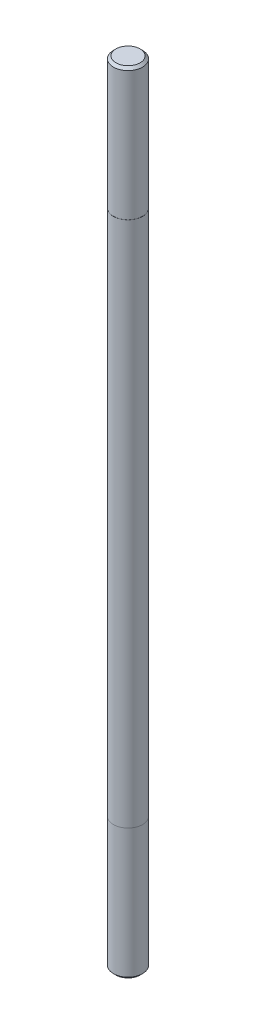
from build123d import *

# Parameters (mm, degrees)
SKETCH1_R          = 2
EXTRUDE1_DEPTH     = 108
CHAMFER2_SIZE      = 0.35
SKETCH2_R          = 7.178092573
SKETCH2_R_2        = 1.99
CUT_EXTRUDE1_DEPTH = 18
CUT_EXTRUDE2_START = -18
SKETCH3_R          = 6.803675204
SKETCH3_R_2        = 1.99
CUT_EXTRUDE2_DEPTH = 18


with BuildPart() as part:
    # Sketch1 → Extrude1 (new body)
    with BuildSketch(Plane(origin=(0, 0, 0), x_dir=(1, 0, 0), z_dir=(0, 1, 0))):
        with Locations(Location((0, 0, 0), (0, 0, 270))):
            Circle(SKETCH1_R)
    extrude(amount=EXTRUDE1_DEPTH)

    # Chamfer2
    chamfer2_edges = [part.edges().sort_by_distance(p)[0] for p in [
        (0, 0, -2),
        (0, 108, -2),
    ]]
    chamfer(chamfer2_edges, length=CHAMFER2_SIZE)

    # Sketch2 → Cut-Extrude1 (cut)
    with BuildSketch(Plane(origin=(0, 108, 0), x_dir=(-1, 0, 0), z_dir=(0, 1, 0))):
        Circle(SKETCH2_R)
        with Locations(Location((0, 0, 0), (0, 0, 90))):
            Circle(SKETCH2_R_2, mode=Mode.SUBTRACT)
    extrude(amount=-CUT_EXTRUDE1_DEPTH, mode=Mode.SUBTRACT)

    # Sketch3 → Cut-Extrude2 (cut)
    with BuildSketch(Plane.XZ.offset(CUT_EXTRUDE2_START)):
        Circle(SKETCH3_R)
        with Locations(Location((0, 0, 0), (0, 0, 90))):
            Circle(SKETCH3_R_2, mode=Mode.SUBTRACT)
    extrude(amount=CUT_EXTRUDE2_DEPTH, mode=Mode.SUBTRACT)


solid = part.part
